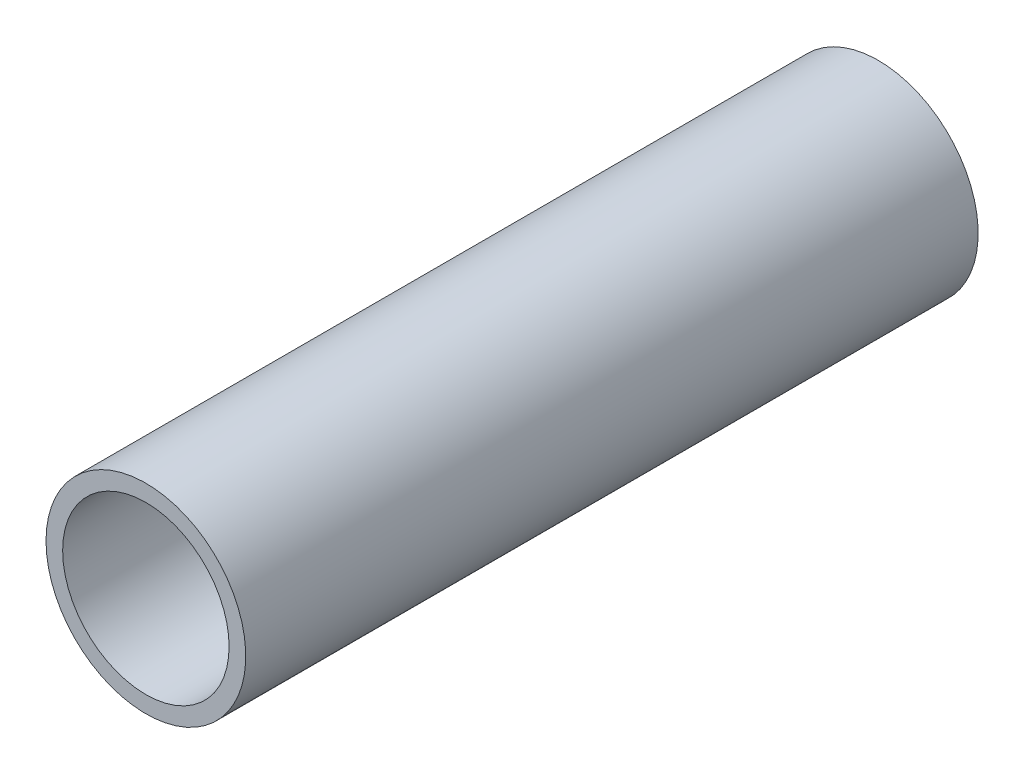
ISO-10303-21;
HEADER;
FILE_DESCRIPTION(('STEP AP214'),'2;1');
FILE_NAME('part.step','',(''),(''),'','','');
FILE_SCHEMA(('AUTOMOTIVE_DESIGN { 1 0 10303 214 1 1 1 1 }'));
ENDSEC;
DATA;
#1=APPLICATION_CONTEXT('core data for automotive mechanical design processes');
#2=APPLICATION_PROTOCOL_DEFINITION('international standard','automotive_design',2000,#1);
#3=PRODUCT_CONTEXT('',#1,'mechanical');
#4=PRODUCT('Part','Part','',(#3));
#5=PRODUCT_RELATED_PRODUCT_CATEGORY('part','',(#4));
#6=PRODUCT_DEFINITION_FORMATION('','',#4);
#7=PRODUCT_DEFINITION_CONTEXT('part definition',#1,'design');
#8=PRODUCT_DEFINITION('design','',#6,#7);
#9=PRODUCT_DEFINITION_SHAPE('','',#8);
#10=(LENGTH_UNIT() NAMED_UNIT(*) SI_UNIT(.MILLI.,.METRE.));
#11=(NAMED_UNIT(*) PLANE_ANGLE_UNIT() SI_UNIT($,.RADIAN.));
#12=(NAMED_UNIT(*) SI_UNIT($,.STERADIAN.) SOLID_ANGLE_UNIT());
#13=UNCERTAINTY_MEASURE_WITH_UNIT(LENGTH_MEASURE(1.E-05),#10,'distance_accuracy_value','');
#14=(GEOMETRIC_REPRESENTATION_CONTEXT(3) GLOBAL_UNCERTAINTY_ASSIGNED_CONTEXT((#13)) GLOBAL_UNIT_ASSIGNED_CONTEXT((#10,
#11,#12)) REPRESENTATION_CONTEXT('',''));
#15=CARTESIAN_POINT('',(0.,0.,0.));
#16=DIRECTION('',(0.,0.,1.));
#17=DIRECTION('',(1.,0.,0.));
#18=AXIS2_PLACEMENT_3D('',#15,#16,#17);
#19=CARTESIAN_POINT('',(-162.802070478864,0.568611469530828,116.914358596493));
#20=DIRECTION('',(0.,0.,-1.));
#21=DIRECTION('',(-1.,0.,0.));
#22=AXIS2_PLACEMENT_3D('',#19,#20,#21);
#23=CYLINDRICAL_SURFACE('',#22,7.9375);
#24=CARTESIAN_POINT('',(-162.802070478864,0.568611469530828,47.0643585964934));
#25=DIRECTION('',(0.,0.,-1.));
#26=DIRECTION('',(-1.,0.,0.));
#27=AXIS2_PLACEMENT_3D('',#24,#25,#26);
#28=CIRCLE('',#27,7.9375);
#29=CARTESIAN_POINT('',(-170.739570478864,0.568611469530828,47.0643585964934));
#30=VERTEX_POINT('',#29);
#31=EDGE_CURVE('E27',#30,#30,#28,.F.);
#32=ORIENTED_EDGE('',*,*,#31,.F.);
#33=EDGE_LOOP('',(#32));
#34=FACE_BOUND('',#33,.T.);
#35=CARTESIAN_POINT('',(-162.802070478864,0.568611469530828,116.914358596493));
#36=DIRECTION('',(0.,0.,-1.));
#37=DIRECTION('',(-1.,0.,0.));
#38=AXIS2_PLACEMENT_3D('',#35,#36,#37);
#39=CIRCLE('',#38,7.9375);
#40=CARTESIAN_POINT('',(-170.739570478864,0.568611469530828,116.914358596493));
#41=VERTEX_POINT('',#40);
#42=EDGE_CURVE('E18',#41,#41,#39,.T.);
#43=ORIENTED_EDGE('',*,*,#42,.F.);
#44=EDGE_LOOP('',(#43));
#45=FACE_BOUND('',#44,.T.);
#46=ADVANCED_FACE('F14',(#34,#45),#23,.F.);
#47=CARTESIAN_POINT('',(-162.802071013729,0.568611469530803,116.914358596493));
#48=DIRECTION('',(0.,0.,1.));
#49=DIRECTION('',(1.,0.,0.));
#50=AXIS2_PLACEMENT_3D('',#47,#48,#49);
#51=PLANE('',#50);
#52=ORIENTED_EDGE('',*,*,#42,.T.);
#53=EDGE_LOOP('',(#52));
#54=FACE_BOUND('',#53,.T.);
#55=CARTESIAN_POINT('',(-162.802071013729,0.5686114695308,116.914358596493));
#56=DIRECTION('',(0.,0.,-1.));
#57=DIRECTION('',(-1.,0.,0.));
#58=AXIS2_PLACEMENT_3D('',#55,#56,#57);
#59=CIRCLE('',#58,9.525);
#60=CARTESIAN_POINT('',(-172.327071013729,0.5686114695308,116.914358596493));
#61=VERTEX_POINT('',#60);
#62=EDGE_CURVE('E22',#61,#61,#59,.T.);
#63=ORIENTED_EDGE('',*,*,#62,.F.);
#64=EDGE_LOOP('',(#63));
#65=FACE_BOUND('',#64,.T.);
#66=ADVANCED_FACE('F35',(#54,#65),#51,.T.);
#67=CARTESIAN_POINT('',(-162.802071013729,0.568611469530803,47.0643585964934));
#68=DIRECTION('',(0.,0.,-1.));
#69=DIRECTION('',(-1.,0.,0.));
#70=AXIS2_PLACEMENT_3D('',#67,#68,#69);
#71=PLANE('',#70);
#72=ORIENTED_EDGE('',*,*,#31,.T.);
#73=EDGE_LOOP('',(#72));
#74=FACE_BOUND('',#73,.T.);
#75=CARTESIAN_POINT('',(-162.802071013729,0.5686114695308,47.0643585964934));
#76=DIRECTION('',(0.,0.,-1.));
#77=DIRECTION('',(-1.,0.,0.));
#78=AXIS2_PLACEMENT_3D('',#75,#76,#77);
#79=CIRCLE('',#78,9.525);
#80=CARTESIAN_POINT('',(-172.327071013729,0.5686114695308,47.0643585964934));
#81=VERTEX_POINT('',#80);
#82=EDGE_CURVE('E10',#81,#81,#79,.F.);
#83=ORIENTED_EDGE('',*,*,#82,.F.);
#84=EDGE_LOOP('',(#83));
#85=FACE_BOUND('',#84,.T.);
#86=ADVANCED_FACE('F45',(#74,#85),#71,.T.);
#87=CARTESIAN_POINT('',(-162.802071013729,0.5686114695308,116.914358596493));
#88=DIRECTION('',(0.,0.,-1.));
#89=DIRECTION('',(-1.,0.,0.));
#90=AXIS2_PLACEMENT_3D('',#87,#88,#89);
#91=CYLINDRICAL_SURFACE('',#90,9.525);
#92=ORIENTED_EDGE('',*,*,#62,.T.);
#93=EDGE_LOOP('',(#92));
#94=FACE_BOUND('',#93,.T.);
#95=ORIENTED_EDGE('',*,*,#82,.T.);
#96=EDGE_LOOP('',(#95));
#97=FACE_BOUND('',#96,.T.);
#98=ADVANCED_FACE('F16',(#94,#97),#91,.T.);
#99=CLOSED_SHELL('',(#46,#66,#86,#98));
#100=MANIFOLD_SOLID_BREP('B1',#99);
#101=ADVANCED_BREP_SHAPE_REPRESENTATION('',(#18,#100),#14);
#102=SHAPE_DEFINITION_REPRESENTATION(#9,#101);
ENDSEC;
END-ISO-10303-21;
